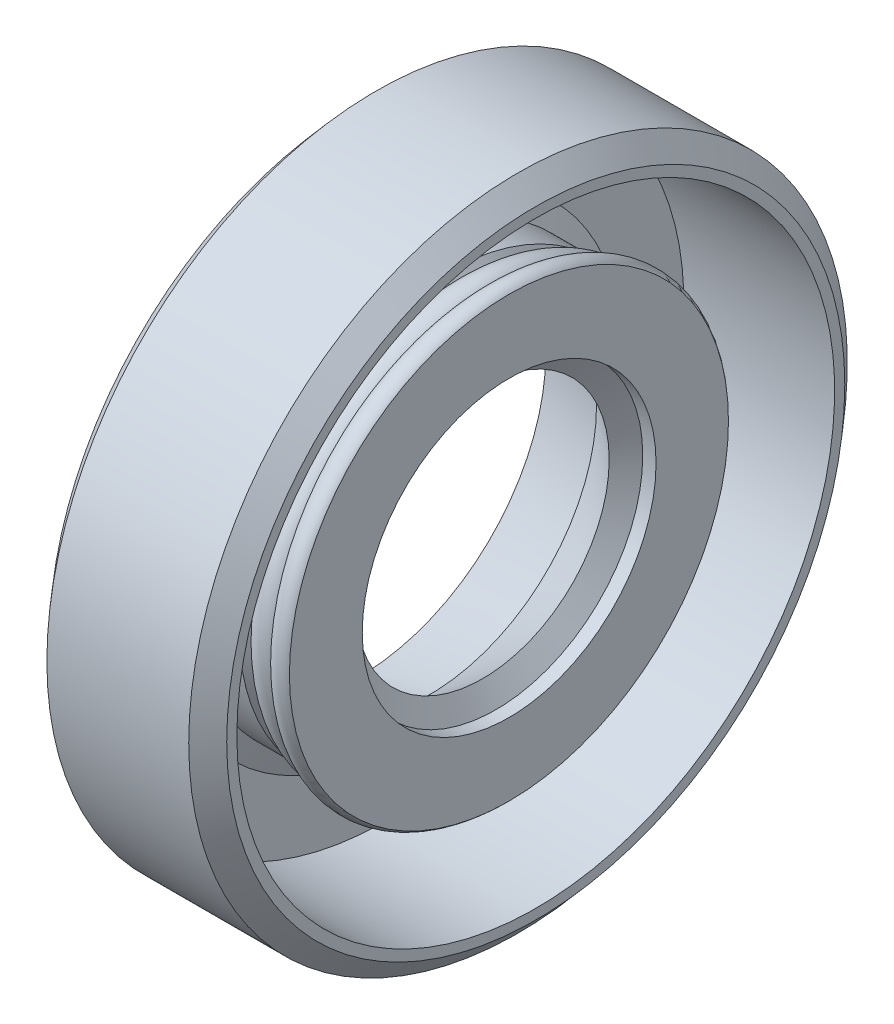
ISO-10303-21;
HEADER;
FILE_DESCRIPTION(('STEP AP214'),'2;1');
FILE_NAME('part.step','',(''),(''),'','','');
FILE_SCHEMA(('AUTOMOTIVE_DESIGN { 1 0 10303 214 1 1 1 1 }'));
ENDSEC;
DATA;
#1=APPLICATION_CONTEXT('core data for automotive mechanical design processes');
#2=APPLICATION_PROTOCOL_DEFINITION('international standard','automotive_design',2000,#1);
#3=PRODUCT_CONTEXT('',#1,'mechanical');
#4=PRODUCT('Part','Part','',(#3));
#5=PRODUCT_RELATED_PRODUCT_CATEGORY('part','',(#4));
#6=PRODUCT_DEFINITION_FORMATION('','',#4);
#7=PRODUCT_DEFINITION_CONTEXT('part definition',#1,'design');
#8=PRODUCT_DEFINITION('design','',#6,#7);
#9=PRODUCT_DEFINITION_SHAPE('','',#8);
#10=(LENGTH_UNIT() NAMED_UNIT(*) SI_UNIT(.MILLI.,.METRE.));
#11=(NAMED_UNIT(*) PLANE_ANGLE_UNIT() SI_UNIT($,.RADIAN.));
#12=(NAMED_UNIT(*) SI_UNIT($,.STERADIAN.) SOLID_ANGLE_UNIT());
#13=UNCERTAINTY_MEASURE_WITH_UNIT(LENGTH_MEASURE(1.E-05),#10,'distance_accuracy_value','');
#14=(GEOMETRIC_REPRESENTATION_CONTEXT(3) GLOBAL_UNCERTAINTY_ASSIGNED_CONTEXT((#13)) GLOBAL_UNIT_ASSIGNED_CONTEXT((#10,
#11,#12)) REPRESENTATION_CONTEXT('',''));
#15=CARTESIAN_POINT('',(0.,0.,0.));
#16=DIRECTION('',(0.,0.,1.));
#17=DIRECTION('',(1.,0.,0.));
#18=AXIS2_PLACEMENT_3D('',#15,#16,#17);
#19=CARTESIAN_POINT('',(7.,0.,0.));
#20=DIRECTION('',(-1.,0.,0.));
#21=DIRECTION('',(0.,0.,1.));
#22=AXIS2_PLACEMENT_3D('',#19,#20,#21);
#23=CYLINDRICAL_SURFACE('',#22,13.);
#24=CARTESIAN_POINT('',(0.7,0.,0.));
#25=DIRECTION('',(-1.,0.,0.));
#26=DIRECTION('',(0.,0.,1.));
#27=AXIS2_PLACEMENT_3D('',#24,#25,#26);
#28=CIRCLE('',#27,13.);
#29=CARTESIAN_POINT('',(0.7,0.,13.));
#30=VERTEX_POINT('',#29);
#31=EDGE_CURVE('E10',#30,#30,#28,.T.);
#32=ORIENTED_EDGE('',*,*,#31,.F.);
#33=EDGE_LOOP('',(#32));
#34=FACE_BOUND('',#33,.T.);
#35=CARTESIAN_POINT('',(6.3,0.,0.));
#36=DIRECTION('',(-1.,0.,0.));
#37=DIRECTION('',(0.,0.,1.));
#38=AXIS2_PLACEMENT_3D('',#35,#36,#37);
#39=CIRCLE('',#38,13.);
#40=CARTESIAN_POINT('',(6.3,0.,13.));
#41=VERTEX_POINT('',#40);
#42=EDGE_CURVE('E96',#41,#41,#39,.T.);
#43=ORIENTED_EDGE('',*,*,#42,.T.);
#44=EDGE_LOOP('',(#43));
#45=FACE_BOUND('',#44,.T.);
#46=ADVANCED_FACE('F14',(#34,#45),#23,.T.);
#47=CARTESIAN_POINT('',(0.7,0.,0.));
#48=DIRECTION('',(1.,0.,0.));
#49=DIRECTION('',(0.,0.,-1.));
#50=AXIS2_PLACEMENT_3D('',#47,#48,#49);
#51=CONICAL_SURFACE('',#50,13.,0.851966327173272);
#52=CARTESIAN_POINT('',(0.,0.,0.));
#53=DIRECTION('',(-1.,0.,0.));
#54=DIRECTION('',(0.,0.,1.));
#55=AXIS2_PLACEMENT_3D('',#52,#53,#54);
#56=CIRCLE('',#55,12.2);
#57=CARTESIAN_POINT('',(0.,0.,12.2));
#58=VERTEX_POINT('',#57);
#59=EDGE_CURVE('E21',#58,#58,#56,.T.);
#60=ORIENTED_EDGE('',*,*,#59,.F.);
#61=EDGE_LOOP('',(#60));
#62=FACE_BOUND('',#61,.T.);
#63=ORIENTED_EDGE('',*,*,#31,.T.);
#64=EDGE_LOOP('',(#63));
#65=FACE_BOUND('',#64,.T.);
#66=ADVANCED_FACE('F194',(#62,#65),#51,.T.);
#67=CARTESIAN_POINT('',(0.,12.2,0.));
#68=DIRECTION('',(1.,0.,0.));
#69=DIRECTION('',(0.,0.,-1.));
#70=AXIS2_PLACEMENT_3D('',#67,#68,#69);
#71=PLANE('',#70);
#72=CARTESIAN_POINT('',(0.,0.,0.));
#73=DIRECTION('',(-1.,0.,0.));
#74=DIRECTION('',(0.,0.,1.));
#75=AXIS2_PLACEMENT_3D('',#72,#73,#74);
#76=CIRCLE('',#75,7.4);
#77=CARTESIAN_POINT('',(0.,0.,7.4));
#78=VERTEX_POINT('',#77);
#79=EDGE_CURVE('E30',#78,#78,#76,.T.);
#80=ORIENTED_EDGE('',*,*,#79,.F.);
#81=EDGE_LOOP('',(#80));
#82=FACE_BOUND('',#81,.T.);
#83=ORIENTED_EDGE('',*,*,#59,.T.);
#84=EDGE_LOOP('',(#83));
#85=FACE_BOUND('',#84,.T.);
#86=ADVANCED_FACE('F189',(#82,#85),#71,.F.);
#87=CARTESIAN_POINT('',(0.,0.,0.));
#88=DIRECTION('',(-1.,0.,0.));
#89=DIRECTION('',(0.,0.,1.));
#90=AXIS2_PLACEMENT_3D('',#87,#88,#89);
#91=CONICAL_SURFACE('',#90,7.4,0.278299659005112);
#92=CARTESIAN_POINT('',(2.8,0.,0.));
#93=DIRECTION('',(-1.,0.,0.));
#94=DIRECTION('',(0.,0.,1.));
#95=AXIS2_PLACEMENT_3D('',#92,#93,#94);
#96=CIRCLE('',#95,6.6);
#97=CARTESIAN_POINT('',(2.8,0.,6.6));
#98=VERTEX_POINT('',#97);
#99=EDGE_CURVE('E38',#98,#98,#96,.T.);
#100=ORIENTED_EDGE('',*,*,#99,.F.);
#101=EDGE_LOOP('',(#100));
#102=FACE_BOUND('',#101,.T.);
#103=ORIENTED_EDGE('',*,*,#79,.T.);
#104=EDGE_LOOP('',(#103));
#105=FACE_BOUND('',#104,.T.);
#106=ADVANCED_FACE('F183',(#102,#105),#91,.F.);
#107=CARTESIAN_POINT('',(2.8,0.,0.));
#108=DIRECTION('',(-1.,0.,0.));
#109=DIRECTION('',(0.,0.,1.));
#110=AXIS2_PLACEMENT_3D('',#107,#108,#109);
#111=CONICAL_SURFACE('',#110,6.6,0.651076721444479);
#112=CARTESIAN_POINT('',(4.9,0.,0.));
#113=DIRECTION('',(-1.,0.,0.));
#114=DIRECTION('',(0.,0.,1.));
#115=AXIS2_PLACEMENT_3D('',#112,#113,#114);
#116=CIRCLE('',#115,5.);
#117=CARTESIAN_POINT('',(4.9,0.,5.));
#118=VERTEX_POINT('',#117);
#119=EDGE_CURVE('E44',#118,#118,#116,.T.);
#120=ORIENTED_EDGE('',*,*,#119,.F.);
#121=EDGE_LOOP('',(#120));
#122=FACE_BOUND('',#121,.T.);
#123=ORIENTED_EDGE('',*,*,#99,.T.);
#124=EDGE_LOOP('',(#123));
#125=FACE_BOUND('',#124,.T.);
#126=ADVANCED_FACE('F177',(#122,#125),#111,.F.);
#127=CARTESIAN_POINT('',(4.9,0.,0.));
#128=DIRECTION('',(1.,0.,0.));
#129=DIRECTION('',(0.,0.,-1.));
#130=AXIS2_PLACEMENT_3D('',#127,#128,#129);
#131=CONICAL_SURFACE('',#130,5.,0.989112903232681);
#132=CARTESIAN_POINT('',(5.42500247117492,0.,0.));
#133=DIRECTION('',(-1.,0.,0.));
#134=DIRECTION('',(0.,0.,1.));
#135=AXIS2_PLACEMENT_3D('',#132,#133,#134);
#136=CIRCLE('',#135,5.79838918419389);
#137=CARTESIAN_POINT('',(5.42500247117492,0.,5.79838918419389));
#138=VERTEX_POINT('',#137);
#139=EDGE_CURVE('E48',#138,#138,#136,.T.);
#140=ORIENTED_EDGE('',*,*,#139,.F.);
#141=EDGE_LOOP('',(#140));
#142=FACE_BOUND('',#141,.T.);
#143=ORIENTED_EDGE('',*,*,#119,.T.);
#144=EDGE_LOOP('',(#143));
#145=FACE_BOUND('',#144,.T.);
#146=ADVANCED_FACE('F171',(#142,#145),#131,.F.);
#147=CARTESIAN_POINT('',(5.42500247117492,0.,0.));
#148=DIRECTION('',(1.,0.,0.));
#149=DIRECTION('',(0.,0.,-1.));
#150=AXIS2_PLACEMENT_3D('',#147,#148,#149);
#151=CONICAL_SURFACE('',#150,5.79838918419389,0.00306822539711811);
#152=CARTESIAN_POINT('',(5.95,0.,0.));
#153=DIRECTION('',(-1.,0.,0.));
#154=DIRECTION('',(0.,0.,1.));
#155=AXIS2_PLACEMENT_3D('',#152,#153,#154);
#156=CIRCLE('',#155,5.8);
#157=CARTESIAN_POINT('',(5.95,0.,5.8));
#158=VERTEX_POINT('',#157);
#159=EDGE_CURVE('E52',#158,#158,#156,.T.);
#160=ORIENTED_EDGE('',*,*,#159,.F.);
#161=EDGE_LOOP('',(#160));
#162=FACE_BOUND('',#161,.T.);
#163=ORIENTED_EDGE('',*,*,#139,.T.);
#164=EDGE_LOOP('',(#163));
#165=FACE_BOUND('',#164,.T.);
#166=ADVANCED_FACE('F165',(#162,#165),#151,.F.);
#167=CARTESIAN_POINT('',(5.95,0.,0.));
#168=DIRECTION('',(-1.,0.,0.));
#169=DIRECTION('',(0.,0.,1.));
#170=AXIS2_PLACEMENT_3D('',#167,#168,#169);
#171=CONICAL_SURFACE('',#170,5.8,1.56772810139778);
#172=CARTESIAN_POINT('',(5.94120580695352,0.,0.));
#173=DIRECTION('',(-1.,0.,0.));
#174=DIRECTION('',(0.,0.,1.));
#175=AXIS2_PLACEMENT_3D('',#172,#173,#174);
#176=CIRCLE('',#175,8.66620580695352);
#177=CARTESIAN_POINT('',(5.94120580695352,0.,8.66620580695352));
#178=VERTEX_POINT('',#177);
#179=EDGE_CURVE('E56',#178,#178,#176,.T.);
#180=ORIENTED_EDGE('',*,*,#179,.F.);
#181=EDGE_LOOP('',(#180));
#182=FACE_BOUND('',#181,.T.);
#183=ORIENTED_EDGE('',*,*,#159,.T.);
#184=EDGE_LOOP('',(#183));
#185=FACE_BOUND('',#184,.T.);
#186=ADVANCED_FACE('F159',(#182,#185),#171,.T.);
#187=CARTESIAN_POINT('',(5.56997474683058,0.,0.));
#188=DIRECTION('',(-1.,0.,0.));
#189=DIRECTION('',(0.,0.,1.));
#190=AXIS2_PLACEMENT_3D('',#187,#188,#189);
#191=TOROIDAL_SURFACE('',#190,8.29497474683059,0.525);
#192=CARTESIAN_POINT('',(5.04497474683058,0.,0.));
#193=DIRECTION('',(-1.,0.,0.));
#194=DIRECTION('',(0.,0.,1.));
#195=AXIS2_PLACEMENT_3D('',#192,#193,#194);
#196=CIRCLE('',#195,8.29497474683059);
#197=CARTESIAN_POINT('',(5.04497474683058,0.,8.29497474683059));
#198=VERTEX_POINT('',#197);
#199=EDGE_CURVE('E60',#198,#198,#196,.T.);
#200=ORIENTED_EDGE('',*,*,#199,.F.);
#201=EDGE_LOOP('',(#200));
#202=FACE_BOUND('',#201,.T.);
#203=ORIENTED_EDGE('',*,*,#179,.T.);
#204=EDGE_LOOP('',(#203));
#205=FACE_BOUND('',#204,.T.);
#206=ADVANCED_FACE('F153',(#202,#205),#191,.T.);
#207=CARTESIAN_POINT('',(4.55,0.,0.));
#208=DIRECTION('',(-1.,0.,0.));
#209=DIRECTION('',(0.,0.,1.));
#210=AXIS2_PLACEMENT_3D('',#207,#208,#209);
#211=TOROIDAL_SURFACE('',#210,7.8,0.7);
#212=CARTESIAN_POINT('',(3.85,0.,0.));
#213=DIRECTION('',(-1.,0.,0.));
#214=DIRECTION('',(0.,0.,1.));
#215=AXIS2_PLACEMENT_3D('',#212,#213,#214);
#216=CIRCLE('',#215,7.8);
#217=CARTESIAN_POINT('',(3.85,0.,7.8));
#218=VERTEX_POINT('',#217);
#219=EDGE_CURVE('E64',#218,#218,#216,.T.);
#220=ORIENTED_EDGE('',*,*,#219,.F.);
#221=EDGE_LOOP('',(#220));
#222=FACE_BOUND('',#221,.T.);
#223=ORIENTED_EDGE('',*,*,#199,.T.);
#224=EDGE_LOOP('',(#223));
#225=FACE_BOUND('',#224,.T.);
#226=ADVANCED_FACE('F147',(#222,#225),#211,.T.);
#227=CARTESIAN_POINT('',(3.85,0.,0.));
#228=DIRECTION('',(-1.,0.,0.));
#229=DIRECTION('',(0.,0.,1.));
#230=AXIS2_PLACEMENT_3D('',#227,#228,#229);
#231=CONICAL_SURFACE('',#230,7.8,0.851966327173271);
#232=CARTESIAN_POINT('',(3.5,0.,0.));
#233=DIRECTION('',(-1.,0.,0.));
#234=DIRECTION('',(0.,0.,1.));
#235=AXIS2_PLACEMENT_3D('',#232,#233,#234);
#236=CIRCLE('',#235,8.2);
#237=CARTESIAN_POINT('',(3.5,0.,8.2));
#238=VERTEX_POINT('',#237);
#239=EDGE_CURVE('E68',#238,#238,#236,.T.);
#240=ORIENTED_EDGE('',*,*,#239,.F.);
#241=EDGE_LOOP('',(#240));
#242=FACE_BOUND('',#241,.T.);
#243=ORIENTED_EDGE('',*,*,#219,.T.);
#244=EDGE_LOOP('',(#243));
#245=FACE_BOUND('',#244,.T.);
#246=ADVANCED_FACE('F141',(#242,#245),#231,.T.);
#247=CARTESIAN_POINT('',(7.,0.,0.));
#248=DIRECTION('',(-1.,0.,0.));
#249=DIRECTION('',(0.,0.,1.));
#250=AXIS2_PLACEMENT_3D('',#247,#248,#249);
#251=CYLINDRICAL_SURFACE('',#250,8.2);
#252=CARTESIAN_POINT('',(1.75,0.,0.));
#253=DIRECTION('',(-1.,0.,0.));
#254=DIRECTION('',(0.,0.,1.));
#255=AXIS2_PLACEMENT_3D('',#252,#253,#254);
#256=CIRCLE('',#255,8.2);
#257=CARTESIAN_POINT('',(1.75,0.,8.2));
#258=VERTEX_POINT('',#257);
#259=EDGE_CURVE('E72',#258,#258,#256,.T.);
#260=ORIENTED_EDGE('',*,*,#259,.F.);
#261=EDGE_LOOP('',(#260));
#262=FACE_BOUND('',#261,.T.);
#263=ORIENTED_EDGE('',*,*,#239,.T.);
#264=EDGE_LOOP('',(#263));
#265=FACE_BOUND('',#264,.T.);
#266=ADVANCED_FACE('F135',(#262,#265),#251,.T.);
#267=CARTESIAN_POINT('',(1.75,0.,0.));
#268=DIRECTION('',(-1.,0.,0.));
#269=DIRECTION('',(0.,0.,1.));
#270=AXIS2_PLACEMENT_3D('',#267,#268,#269);
#271=CONICAL_SURFACE('',#270,8.2,1.15838588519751);
#272=CARTESIAN_POINT('',(1.4,0.,0.));
#273=DIRECTION('',(-1.,0.,0.));
#274=DIRECTION('',(0.,0.,1.));
#275=AXIS2_PLACEMENT_3D('',#272,#273,#274);
#276=CIRCLE('',#275,9.);
#277=CARTESIAN_POINT('',(1.4,0.,9.));
#278=VERTEX_POINT('',#277);
#279=EDGE_CURVE('E76',#278,#278,#276,.T.);
#280=ORIENTED_EDGE('',*,*,#279,.F.);
#281=EDGE_LOOP('',(#280));
#282=FACE_BOUND('',#281,.T.);
#283=ORIENTED_EDGE('',*,*,#259,.T.);
#284=EDGE_LOOP('',(#283));
#285=FACE_BOUND('',#284,.T.);
#286=ADVANCED_FACE('F129',(#282,#285),#271,.T.);
#287=CARTESIAN_POINT('',(7.,0.,0.));
#288=DIRECTION('',(-1.,0.,0.));
#289=DIRECTION('',(0.,0.,1.));
#290=AXIS2_PLACEMENT_3D('',#287,#288,#289);
#291=CYLINDRICAL_SURFACE('',#290,9.);
#292=CARTESIAN_POINT('',(1.05,0.,0.));
#293=DIRECTION('',(-1.,0.,0.));
#294=DIRECTION('',(0.,0.,1.));
#295=AXIS2_PLACEMENT_3D('',#292,#293,#294);
#296=CIRCLE('',#295,9.);
#297=CARTESIAN_POINT('',(1.05,0.,9.));
#298=VERTEX_POINT('',#297);
#299=EDGE_CURVE('E80',#298,#298,#296,.T.);
#300=ORIENTED_EDGE('',*,*,#299,.F.);
#301=EDGE_LOOP('',(#300));
#302=FACE_BOUND('',#301,.T.);
#303=ORIENTED_EDGE('',*,*,#279,.T.);
#304=EDGE_LOOP('',(#303));
#305=FACE_BOUND('',#304,.T.);
#306=ADVANCED_FACE('F123',(#302,#305),#291,.T.);
#307=CARTESIAN_POINT('',(1.05,9.,0.));
#308=DIRECTION('',(-1.,0.,0.));
#309=DIRECTION('',(0.,0.,1.));
#310=AXIS2_PLACEMENT_3D('',#307,#308,#309);
#311=PLANE('',#310);
#312=CARTESIAN_POINT('',(1.05,0.,0.));
#313=DIRECTION('',(-1.,0.,0.));
#314=DIRECTION('',(0.,0.,1.));
#315=AXIS2_PLACEMENT_3D('',#312,#313,#314);
#316=CIRCLE('',#315,11.8);
#317=CARTESIAN_POINT('',(1.05,0.,11.8));
#318=VERTEX_POINT('',#317);
#319=EDGE_CURVE('E84',#318,#318,#316,.T.);
#320=ORIENTED_EDGE('',*,*,#319,.F.);
#321=EDGE_LOOP('',(#320));
#322=FACE_BOUND('',#321,.T.);
#323=ORIENTED_EDGE('',*,*,#299,.T.);
#324=EDGE_LOOP('',(#323));
#325=FACE_BOUND('',#324,.T.);
#326=ADVANCED_FACE('F117',(#322,#325),#311,.F.);
#327=CARTESIAN_POINT('',(7.,0.,0.));
#328=DIRECTION('',(-1.,0.,0.));
#329=DIRECTION('',(0.,0.,1.));
#330=AXIS2_PLACEMENT_3D('',#327,#328,#329);
#331=CYLINDRICAL_SURFACE('',#330,11.8);
#332=CARTESIAN_POINT('',(7.,0.,0.));
#333=DIRECTION('',(-1.,0.,0.));
#334=DIRECTION('',(0.,0.,1.));
#335=AXIS2_PLACEMENT_3D('',#332,#333,#334);
#336=CIRCLE('',#335,11.8);
#337=CARTESIAN_POINT('',(7.,0.,11.8));
#338=VERTEX_POINT('',#337);
#339=EDGE_CURVE('E88',#338,#338,#336,.T.);
#340=ORIENTED_EDGE('',*,*,#339,.F.);
#341=EDGE_LOOP('',(#340));
#342=FACE_BOUND('',#341,.T.);
#343=ORIENTED_EDGE('',*,*,#319,.T.);
#344=EDGE_LOOP('',(#343));
#345=FACE_BOUND('',#344,.T.);
#346=ADVANCED_FACE('F111',(#342,#345),#331,.F.);
#347=CARTESIAN_POINT('',(7.,11.8,0.));
#348=DIRECTION('',(-1.,0.,0.));
#349=DIRECTION('',(0.,0.,1.));
#350=AXIS2_PLACEMENT_3D('',#347,#348,#349);
#351=PLANE('',#350);
#352=CARTESIAN_POINT('',(7.,0.,0.));
#353=DIRECTION('',(-1.,0.,0.));
#354=DIRECTION('',(0.,0.,1.));
#355=AXIS2_PLACEMENT_3D('',#352,#353,#354);
#356=CIRCLE('',#355,12.2);
#357=CARTESIAN_POINT('',(7.,0.,12.2));
#358=VERTEX_POINT('',#357);
#359=EDGE_CURVE('E92',#358,#358,#356,.T.);
#360=ORIENTED_EDGE('',*,*,#359,.F.);
#361=EDGE_LOOP('',(#360));
#362=FACE_BOUND('',#361,.T.);
#363=ORIENTED_EDGE('',*,*,#339,.T.);
#364=EDGE_LOOP('',(#363));
#365=FACE_BOUND('',#364,.T.);
#366=ADVANCED_FACE('F105',(#362,#365),#351,.F.);
#367=CARTESIAN_POINT('',(7.,0.,0.));
#368=DIRECTION('',(-1.,0.,0.));
#369=DIRECTION('',(0.,0.,1.));
#370=AXIS2_PLACEMENT_3D('',#367,#368,#369);
#371=CONICAL_SURFACE('',#370,12.2,0.851966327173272);
#372=ORIENTED_EDGE('',*,*,#42,.F.);
#373=EDGE_LOOP('',(#372));
#374=FACE_BOUND('',#373,.T.);
#375=ORIENTED_EDGE('',*,*,#359,.T.);
#376=EDGE_LOOP('',(#375));
#377=FACE_BOUND('',#376,.T.);
#378=ADVANCED_FACE('F102',(#374,#377),#371,.T.);
#379=CLOSED_SHELL('',(#46,#66,#86,#106,#126,#146,#166,#186,#206,#226,#246,#266,#286,#306,#326,
#346,#366,#378));
#380=MANIFOLD_SOLID_BREP('B1',#379);
#381=ADVANCED_BREP_SHAPE_REPRESENTATION('',(#18,#380),#14);
#382=SHAPE_DEFINITION_REPRESENTATION(#9,#381);
ENDSEC;
END-ISO-10303-21;
